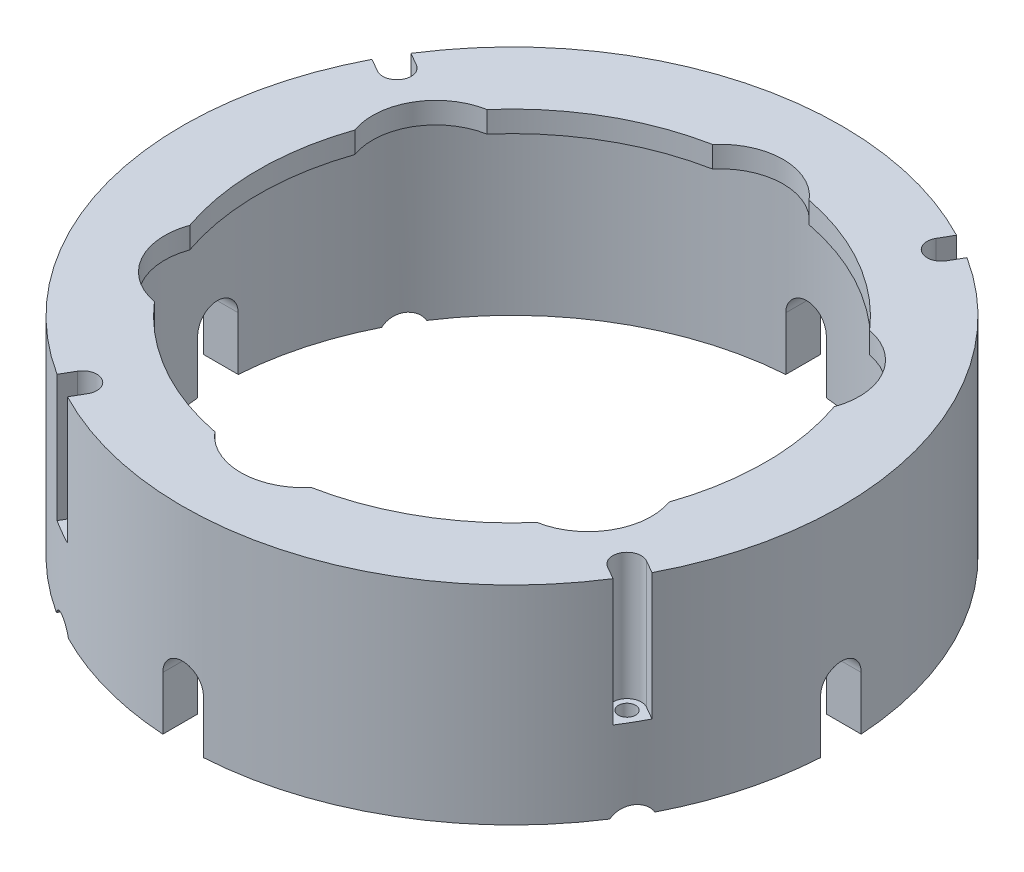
from build123d import *

# Parameters (mm, degrees)
SKETCH7_R          = 4.7625
CUT_EXTRUDE3_DEPTH = 128.829143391
CUT_EXTRUDE1_DEPTH = 12.7
CIRPATTERN1_COUNT  = 4
SKETCH6_R          = 15.875
CUT_EXTRUDE2_DEPTH = 128.829143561
CIRPATTERN2_COUNT  = 6
SKETCH11_R         = 2.159
CUT_EXTRUDE5_DEPTH = 128.829143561
CUT_EXTRUDE4_DEPTH = 31.75
CIRPATTERN3_COUNT  = 4


with BuildPart() as part:
    # Sketch1 → Revolve1 (revolve)
    with BuildSketch(Plane.XY, mode=Mode.PRIVATE) as revolve1_sk:
        Polygon((-63.5, 0), (-82.55, 0), (-82.55, -52.07), (-73.8378, -52.07), (-73.8378, -5.334), (-63.5, -5.334), align=None)
    revolve(revolve1_sk.sketch.rotate(Axis((0, -5.438845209, 0), (0, -1, 0)), 270), axis=Axis((0, -5.438845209, 0), (0, -1, 0)))

    # Sketch7 → Cut-Extrude3 (cut, through all)
    with BuildSketch(Plane(origin=(0, 0, 0), x_dir=(0, -1, 0), z_dir=(-0.500000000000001, 0, 0.866025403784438))):
        with Locations((54.45125, 0)):
            Circle(SKETCH7_R)
    cut_extrude3 = extrude(amount=-CUT_EXTRUDE3_DEPTH, mode=Mode.SUBTRACT)

    # Sketch5 → Cut-Extrude1 (cut)
    with BuildSketch(Plane(origin=(0, 0, -82.55), x_dir=(-1, 0, 0), z_dir=(0, 0, -1))):
        with BuildLine():
            Line((-5.08, -57.734581), (-5.08, -38.673194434))
            ThreePointArc((-5.08, -38.673194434), (0, -33.593194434), (5.08, -38.673194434))
            Line((5.08, -38.673194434), (5.08, -57.734581))
            ThreePointArc((5.08, -57.734581), (0, -62.814581), (-5.08, -57.734581))
        make_face()
    cut_extrude1 = extrude(amount=-CUT_EXTRUDE1_DEPTH, mode=Mode.SUBTRACT)

    # CirPattern1: Cut-Extrude3, Cut-Extrude1 ×4 about axis
    cirpattern1_axis = Axis((0, 0, 0), (0, 1, 0))
    add([cut_extrude3.rotate(cirpattern1_axis, i * 360 / CIRPATTERN1_COUNT) for i in range(1, CIRPATTERN1_COUNT)], mode=Mode.SUBTRACT)
    add([cut_extrude1.rotate(cirpattern1_axis, i * 360 / CIRPATTERN1_COUNT) for i in range(1, CIRPATTERN1_COUNT)], mode=Mode.SUBTRACT)

    # Sketch6 → Cut-Extrude2 (cut, through all)
    with BuildSketch(Plane(origin=(0, 0, 0), x_dir=(1, 0, 0), z_dir=(0, 1, 0))):
        with Locations((-45.093942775, 26.035)):
            Circle(SKETCH6_R)
    cut_extrude2 = extrude(amount=-CUT_EXTRUDE2_DEPTH, mode=Mode.SUBTRACT)

    # CirPattern2: Cut-Extrude2 ×6 about axis
    cirpattern2_axis = Axis((0, 0, 0), (0, 1, 0))
    for i in range(1, CIRPATTERN2_COUNT):
        add(cut_extrude2.rotate(cirpattern2_axis, i * 360 / CIRPATTERN2_COUNT), mode=Mode.SUBTRACT)

    # Sketch11 → Cut-Extrude5 (cut, through all)
    with BuildSketch(Plane(origin=(0, 0, 0), x_dir=(1, 0, 0), z_dir=(0, 1, 0))):
        with Locations(Location((68.190840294, -39.37, 0), (0, 0, 270))):
            Circle(SKETCH11_R)
    cut_extrude5 = extrude(amount=-CUT_EXTRUDE5_DEPTH, mode=Mode.SUBTRACT)

    # Sketch10 → Cut-Extrude4 (cut)
    with BuildSketch(Plane(origin=(0, 0, 0), x_dir=(1, 0, 0), z_dir=(0, 1, 0))):
        with BuildLine():
            Line((69.976777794, -36.276665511), (87.619746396, -46.462838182))
            Line((87.619746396, -46.462838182), (82.584694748, -51.804741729))
            Line((82.584694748, -51.804741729), (66.404902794, -42.463334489))
            ThreePointArc((66.404902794, -42.463334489), (65.097505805, -37.5840625), (69.976777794, -36.276665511))
        make_face()
    cut_extrude4 = extrude(amount=-CUT_EXTRUDE4_DEPTH, mode=Mode.SUBTRACT)

    # CirPattern3: Cut-Extrude5, Cut-Extrude4 ×4 about axis
    cirpattern3_axis = Axis((0, 0, 0), (0, 1, 0))
    add([cut_extrude5.rotate(cirpattern3_axis, i * 360 / CIRPATTERN3_COUNT) for i in range(1, CIRPATTERN3_COUNT)], mode=Mode.SUBTRACT)
    add([cut_extrude4.rotate(cirpattern3_axis, i * 360 / CIRPATTERN3_COUNT) for i in range(1, CIRPATTERN3_COUNT)], mode=Mode.SUBTRACT)


solid = part.part
